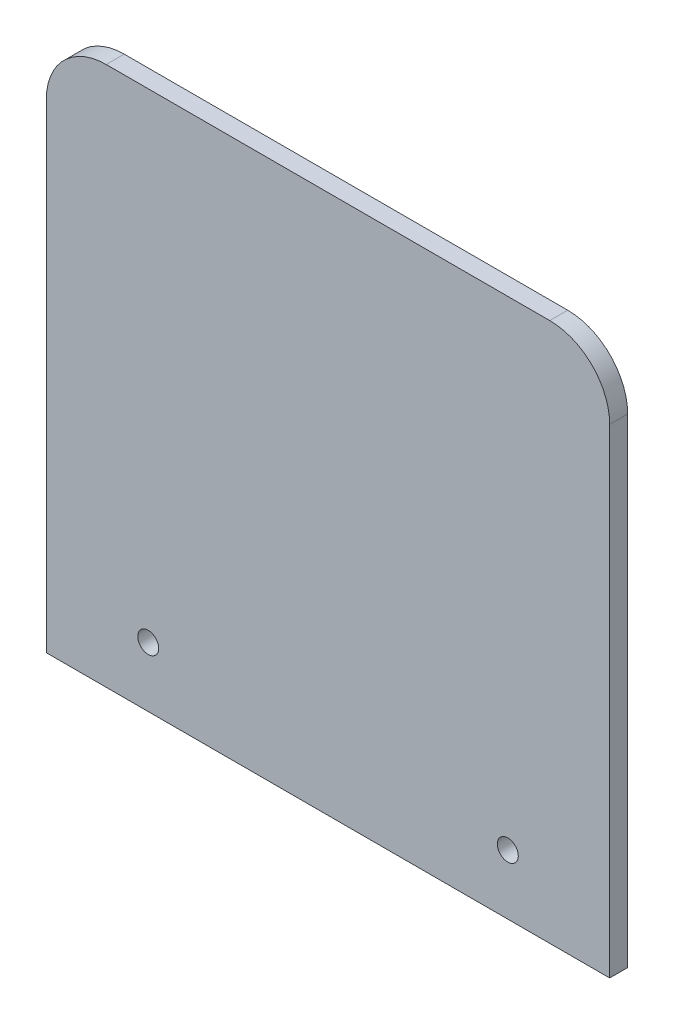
ISO-10303-21;
HEADER;
FILE_DESCRIPTION(('STEP AP214'),'2;1');
FILE_NAME('part.step','',(''),(''),'','','');
FILE_SCHEMA(('AUTOMOTIVE_DESIGN { 1 0 10303 214 1 1 1 1 }'));
ENDSEC;
DATA;
#1=APPLICATION_CONTEXT('core data for automotive mechanical design processes');
#2=APPLICATION_PROTOCOL_DEFINITION('international standard','automotive_design',2000,#1);
#3=PRODUCT_CONTEXT('',#1,'mechanical');
#4=PRODUCT('Part','Part','',(#3));
#5=PRODUCT_RELATED_PRODUCT_CATEGORY('part','',(#4));
#6=PRODUCT_DEFINITION_FORMATION('','',#4);
#7=PRODUCT_DEFINITION_CONTEXT('part definition',#1,'design');
#8=PRODUCT_DEFINITION('design','',#6,#7);
#9=PRODUCT_DEFINITION_SHAPE('','',#8);
#10=(LENGTH_UNIT() NAMED_UNIT(*) SI_UNIT(.MILLI.,.METRE.));
#11=(NAMED_UNIT(*) PLANE_ANGLE_UNIT() SI_UNIT($,.RADIAN.));
#12=(NAMED_UNIT(*) SI_UNIT($,.STERADIAN.) SOLID_ANGLE_UNIT());
#13=UNCERTAINTY_MEASURE_WITH_UNIT(LENGTH_MEASURE(1.E-05),#10,'distance_accuracy_value','');
#14=(GEOMETRIC_REPRESENTATION_CONTEXT(3) GLOBAL_UNCERTAINTY_ASSIGNED_CONTEXT((#13)) GLOBAL_UNIT_ASSIGNED_CONTEXT((#10,
#11,#12)) REPRESENTATION_CONTEXT('',''));
#15=CARTESIAN_POINT('',(0.,0.,0.));
#16=DIRECTION('',(0.,0.,1.));
#17=DIRECTION('',(1.,0.,0.));
#18=AXIS2_PLACEMENT_3D('',#15,#16,#17);
#19=CARTESIAN_POINT('',(10.,80.,3.));
#20=DIRECTION('',(0.,0.,-1.));
#21=DIRECTION('',(-1.,0.,0.));
#22=AXIS2_PLACEMENT_3D('',#19,#20,#21);
#23=PLANE('',#22);
#24=CARTESIAN_POINT('',(77.,10.,3.));
#25=DIRECTION('',(0.,0.,1.));
#26=DIRECTION('',(1.,0.,0.));
#27=AXIS2_PLACEMENT_3D('',#24,#25,#26);
#28=CIRCLE('',#27,1.75);
#29=CARTESIAN_POINT('',(78.75,10.,3.));
#30=VERTEX_POINT('',#29);
#31=EDGE_CURVE('E120',#30,#30,#28,.T.);
#32=ORIENTED_EDGE('',*,*,#31,.F.);
#33=EDGE_LOOP('',(#32));
#34=FACE_BOUND('',#33,.T.);
#35=DIRECTION('',(0.,-1.,0.));
#36=VECTOR('',#35,1.);
#37=CARTESIAN_POINT('',(0.,0.,3.));
#38=LINE('',#37,#36);
#39=CARTESIAN_POINT('',(0.,80.,3.));
#40=VERTEX_POINT('',#39);
#41=CARTESIAN_POINT('',(0.,0.,3.));
#42=VERTEX_POINT('',#41);
#43=EDGE_CURVE('E127',#40,#42,#38,.T.);
#44=ORIENTED_EDGE('',*,*,#43,.T.);
#45=DIRECTION('',(1.,0.,0.));
#46=VECTOR('',#45,1.);
#47=CARTESIAN_POINT('',(0.,0.,3.));
#48=LINE('',#47,#46);
#49=CARTESIAN_POINT('',(94.,0.,3.));
#50=VERTEX_POINT('',#49);
#51=EDGE_CURVE('E85',#42,#50,#48,.T.);
#52=ORIENTED_EDGE('',*,*,#51,.T.);
#53=DIRECTION('',(0.,1.,0.));
#54=VECTOR('',#53,1.);
#55=CARTESIAN_POINT('',(94.,0.,3.));
#56=LINE('',#55,#54);
#57=CARTESIAN_POINT('',(94.,80.0000000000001,3.));
#58=VERTEX_POINT('',#57);
#59=EDGE_CURVE('E98',#50,#58,#56,.T.);
#60=ORIENTED_EDGE('',*,*,#59,.T.);
#61=CARTESIAN_POINT('',(84.,80.0000000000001,3.));
#62=DIRECTION('',(0.,0.,1.));
#63=DIRECTION('',(1.,0.,0.));
#64=AXIS2_PLACEMENT_3D('',#61,#62,#63);
#65=CIRCLE('',#64,9.99999999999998);
#66=CARTESIAN_POINT('',(84.,90.,3.));
#67=VERTEX_POINT('',#66);
#68=EDGE_CURVE('E92',#58,#67,#65,.T.);
#69=ORIENTED_EDGE('',*,*,#68,.T.);
#70=DIRECTION('',(-1.,0.,0.));
#71=VECTOR('',#70,1.);
#72=CARTESIAN_POINT('',(10.,90.,3.));
#73=LINE('',#72,#71);
#74=CARTESIAN_POINT('',(10.,90.,3.));
#75=VERTEX_POINT('',#74);
#76=EDGE_CURVE('E96',#67,#75,#73,.T.);
#77=ORIENTED_EDGE('',*,*,#76,.T.);
#78=CARTESIAN_POINT('',(10.,80.,3.));
#79=DIRECTION('',(0.,0.,1.));
#80=DIRECTION('',(-1.,0.,0.));
#81=AXIS2_PLACEMENT_3D('',#78,#79,#80);
#82=CIRCLE('',#81,9.99999999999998);
#83=EDGE_CURVE('E48',#75,#40,#82,.T.);
#84=ORIENTED_EDGE('',*,*,#83,.T.);
#85=EDGE_LOOP('',(#44,#52,#60,#69,#77,#84));
#86=FACE_BOUND('',#85,.T.);
#87=CARTESIAN_POINT('',(17.,10.,3.));
#88=DIRECTION('',(0.,0.,1.));
#89=DIRECTION('',(1.,0.,0.));
#90=AXIS2_PLACEMENT_3D('',#87,#88,#89);
#91=CIRCLE('',#90,1.75);
#92=CARTESIAN_POINT('',(18.75,10.,3.));
#93=VERTEX_POINT('',#92);
#94=EDGE_CURVE('E170',#93,#93,#91,.T.);
#95=ORIENTED_EDGE('',*,*,#94,.F.);
#96=EDGE_LOOP('',(#95));
#97=FACE_BOUND('',#96,.T.);
#98=ADVANCED_FACE('F31',(#34,#86,#97),#23,.F.);
#99=CARTESIAN_POINT('',(10.,80.,0.));
#100=DIRECTION('',(0.,0.,-1.));
#101=DIRECTION('',(-1.,0.,0.));
#102=AXIS2_PLACEMENT_3D('',#99,#100,#101);
#103=PLANE('',#102);
#104=CARTESIAN_POINT('',(77.,10.,0.));
#105=DIRECTION('',(0.,0.,1.));
#106=DIRECTION('',(1.,0.,0.));
#107=AXIS2_PLACEMENT_3D('',#104,#105,#106);
#108=CIRCLE('',#107,1.75);
#109=CARTESIAN_POINT('',(78.75,10.,0.));
#110=VERTEX_POINT('',#109);
#111=EDGE_CURVE('E175',#110,#110,#108,.T.);
#112=ORIENTED_EDGE('',*,*,#111,.T.);
#113=EDGE_LOOP('',(#112));
#114=FACE_BOUND('',#113,.T.);
#115=DIRECTION('',(0.,-1.,0.));
#116=VECTOR('',#115,1.);
#117=CARTESIAN_POINT('',(0.,0.,0.));
#118=LINE('',#117,#116);
#119=CARTESIAN_POINT('',(0.,80.,0.));
#120=VERTEX_POINT('',#119);
#121=CARTESIAN_POINT('',(0.,0.,0.));
#122=VERTEX_POINT('',#121);
#123=EDGE_CURVE('E116',#120,#122,#118,.T.);
#124=ORIENTED_EDGE('',*,*,#123,.F.);
#125=CARTESIAN_POINT('',(10.,80.,0.));
#126=DIRECTION('',(0.,0.,1.));
#127=DIRECTION('',(-1.,0.,0.));
#128=AXIS2_PLACEMENT_3D('',#125,#126,#127);
#129=CIRCLE('',#128,9.99999999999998);
#130=CARTESIAN_POINT('',(10.,90.,0.));
#131=VERTEX_POINT('',#130);
#132=EDGE_CURVE('E77',#131,#120,#129,.T.);
#133=ORIENTED_EDGE('',*,*,#132,.F.);
#134=DIRECTION('',(-1.,0.,0.));
#135=VECTOR('',#134,1.);
#136=CARTESIAN_POINT('',(10.,90.,0.));
#137=LINE('',#136,#135);
#138=CARTESIAN_POINT('',(84.,90.,0.));
#139=VERTEX_POINT('',#138);
#140=EDGE_CURVE('E71',#139,#131,#137,.T.);
#141=ORIENTED_EDGE('',*,*,#140,.F.);
#142=CARTESIAN_POINT('',(84.,80.0000000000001,0.));
#143=DIRECTION('',(0.,0.,1.));
#144=DIRECTION('',(1.,0.,0.));
#145=AXIS2_PLACEMENT_3D('',#142,#143,#144);
#146=CIRCLE('',#145,9.99999999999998);
#147=CARTESIAN_POINT('',(94.,80.0000000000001,0.));
#148=VERTEX_POINT('',#147);
#149=EDGE_CURVE('E106',#148,#139,#146,.T.);
#150=ORIENTED_EDGE('',*,*,#149,.F.);
#151=DIRECTION('',(0.,1.,0.));
#152=VECTOR('',#151,1.);
#153=CARTESIAN_POINT('',(94.,0.,0.));
#154=LINE('',#153,#152);
#155=CARTESIAN_POINT('',(94.,0.,0.));
#156=VERTEX_POINT('',#155);
#157=EDGE_CURVE('E122',#156,#148,#154,.T.);
#158=ORIENTED_EDGE('',*,*,#157,.F.);
#159=DIRECTION('',(1.,0.,0.));
#160=VECTOR('',#159,1.);
#161=CARTESIAN_POINT('',(0.,0.,0.));
#162=LINE('',#161,#160);
#163=EDGE_CURVE('E119',#122,#156,#162,.T.);
#164=ORIENTED_EDGE('',*,*,#163,.F.);
#165=EDGE_LOOP('',(#124,#133,#141,#150,#158,#164));
#166=FACE_BOUND('',#165,.T.);
#167=CARTESIAN_POINT('',(17.,10.,0.));
#168=DIRECTION('',(0.,0.,1.));
#169=DIRECTION('',(1.,0.,0.));
#170=AXIS2_PLACEMENT_3D('',#167,#168,#169);
#171=CIRCLE('',#170,1.75);
#172=CARTESIAN_POINT('',(18.75,10.,0.));
#173=VERTEX_POINT('',#172);
#174=EDGE_CURVE('E173',#173,#173,#171,.T.);
#175=ORIENTED_EDGE('',*,*,#174,.T.);
#176=EDGE_LOOP('',(#175));
#177=FACE_BOUND('',#176,.T.);
#178=ADVANCED_FACE('F136',(#114,#166,#177),#103,.T.);
#179=CARTESIAN_POINT('',(0.,0.,3.));
#180=DIRECTION('',(1.,0.,0.));
#181=DIRECTION('',(0.,0.,-1.));
#182=AXIS2_PLACEMENT_3D('',#179,#180,#181);
#183=PLANE('',#182);
#184=ORIENTED_EDGE('',*,*,#123,.T.);
#185=DIRECTION('',(0.,0.,-1.));
#186=VECTOR('',#185,1.);
#187=CARTESIAN_POINT('',(0.,0.,3.));
#188=LINE('',#187,#186);
#189=EDGE_CURVE('E11',#42,#122,#188,.T.);
#190=ORIENTED_EDGE('',*,*,#189,.F.);
#191=ORIENTED_EDGE('',*,*,#43,.F.);
#192=DIRECTION('',(0.,0.,-1.));
#193=VECTOR('',#192,1.);
#194=CARTESIAN_POINT('',(0.,80.,3.));
#195=LINE('',#194,#193);
#196=EDGE_CURVE('E112',#40,#120,#195,.T.);
#197=ORIENTED_EDGE('',*,*,#196,.T.);
#198=EDGE_LOOP('',(#184,#190,#191,#197));
#199=FACE_BOUND('',#198,.T.);
#200=ADVANCED_FACE('F33',(#199),#183,.F.);
#201=CARTESIAN_POINT('',(0.,0.,3.));
#202=DIRECTION('',(0.,1.,0.));
#203=DIRECTION('',(-1.,0.,0.));
#204=AXIS2_PLACEMENT_3D('',#201,#202,#203);
#205=PLANE('',#204);
#206=ORIENTED_EDGE('',*,*,#163,.T.);
#207=DIRECTION('',(0.,0.,-1.));
#208=VECTOR('',#207,1.);
#209=CARTESIAN_POINT('',(94.,0.,3.));
#210=LINE('',#209,#208);
#211=EDGE_CURVE('E40',#50,#156,#210,.T.);
#212=ORIENTED_EDGE('',*,*,#211,.F.);
#213=ORIENTED_EDGE('',*,*,#51,.F.);
#214=ORIENTED_EDGE('',*,*,#189,.T.);
#215=EDGE_LOOP('',(#206,#212,#213,#214));
#216=FACE_BOUND('',#215,.T.);
#217=ADVANCED_FACE('F216',(#216),#205,.F.);
#218=CARTESIAN_POINT('',(94.,0.,3.));
#219=DIRECTION('',(-1.,0.,0.));
#220=DIRECTION('',(0.,-1.,0.));
#221=AXIS2_PLACEMENT_3D('',#218,#219,#220);
#222=PLANE('',#221);
#223=ORIENTED_EDGE('',*,*,#157,.T.);
#224=DIRECTION('',(0.,0.,-1.));
#225=VECTOR('',#224,1.);
#226=CARTESIAN_POINT('',(94.,80.0000000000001,3.));
#227=LINE('',#226,#225);
#228=EDGE_CURVE('E107',#58,#148,#227,.T.);
#229=ORIENTED_EDGE('',*,*,#228,.F.);
#230=ORIENTED_EDGE('',*,*,#59,.F.);
#231=ORIENTED_EDGE('',*,*,#211,.T.);
#232=EDGE_LOOP('',(#223,#229,#230,#231));
#233=FACE_BOUND('',#232,.T.);
#234=ADVANCED_FACE('F133',(#233),#222,.F.);
#235=CARTESIAN_POINT('',(84.,80.0000000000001,3.));
#236=DIRECTION('',(0.,0.,-1.));
#237=DIRECTION('',(-1.,0.,0.));
#238=AXIS2_PLACEMENT_3D('',#235,#236,#237);
#239=CYLINDRICAL_SURFACE('',#238,9.99999999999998);
#240=ORIENTED_EDGE('',*,*,#149,.T.);
#241=DIRECTION('',(0.,0.,-1.));
#242=VECTOR('',#241,1.);
#243=CARTESIAN_POINT('',(84.,90.,3.));
#244=LINE('',#243,#242);
#245=EDGE_CURVE('E103',#67,#139,#244,.T.);
#246=ORIENTED_EDGE('',*,*,#245,.F.);
#247=ORIENTED_EDGE('',*,*,#68,.F.);
#248=ORIENTED_EDGE('',*,*,#228,.T.);
#249=EDGE_LOOP('',(#240,#246,#247,#248));
#250=FACE_BOUND('',#249,.T.);
#251=ADVANCED_FACE('F104',(#250),#239,.T.);
#252=CARTESIAN_POINT('',(10.,90.,3.));
#253=DIRECTION('',(0.,-1.,0.));
#254=DIRECTION('',(1.,0.,0.));
#255=AXIS2_PLACEMENT_3D('',#252,#253,#254);
#256=PLANE('',#255);
#257=ORIENTED_EDGE('',*,*,#140,.T.);
#258=DIRECTION('',(0.,0.,-1.));
#259=VECTOR('',#258,1.);
#260=CARTESIAN_POINT('',(10.,90.,3.));
#261=LINE('',#260,#259);
#262=EDGE_CURVE('E108',#75,#131,#261,.T.);
#263=ORIENTED_EDGE('',*,*,#262,.F.);
#264=ORIENTED_EDGE('',*,*,#76,.F.);
#265=ORIENTED_EDGE('',*,*,#245,.T.);
#266=EDGE_LOOP('',(#257,#263,#264,#265));
#267=FACE_BOUND('',#266,.T.);
#268=ADVANCED_FACE('F110',(#267),#256,.F.);
#269=CARTESIAN_POINT('',(10.,80.,3.));
#270=DIRECTION('',(0.,0.,-1.));
#271=DIRECTION('',(-1.,0.,0.));
#272=AXIS2_PLACEMENT_3D('',#269,#270,#271);
#273=CYLINDRICAL_SURFACE('',#272,9.99999999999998);
#274=ORIENTED_EDGE('',*,*,#132,.T.);
#275=ORIENTED_EDGE('',*,*,#196,.F.);
#276=ORIENTED_EDGE('',*,*,#83,.F.);
#277=ORIENTED_EDGE('',*,*,#262,.T.);
#278=EDGE_LOOP('',(#274,#275,#276,#277));
#279=FACE_BOUND('',#278,.T.);
#280=ADVANCED_FACE('F141',(#279),#273,.T.);
#281=CARTESIAN_POINT('',(77.,10.,3.));
#282=DIRECTION('',(0.,0.,-1.));
#283=DIRECTION('',(-1.,0.,0.));
#284=AXIS2_PLACEMENT_3D('',#281,#282,#283);
#285=CYLINDRICAL_SURFACE('',#284,1.75);
#286=ORIENTED_EDGE('',*,*,#31,.T.);
#287=EDGE_LOOP('',(#286));
#288=FACE_BOUND('',#287,.T.);
#289=ORIENTED_EDGE('',*,*,#111,.F.);
#290=EDGE_LOOP('',(#289));
#291=FACE_BOUND('',#290,.T.);
#292=ADVANCED_FACE('F143',(#288,#291),#285,.F.);
#293=CARTESIAN_POINT('',(17.,10.,3.));
#294=DIRECTION('',(0.,0.,-1.));
#295=DIRECTION('',(-1.,0.,0.));
#296=AXIS2_PLACEMENT_3D('',#293,#294,#295);
#297=CYLINDRICAL_SURFACE('',#296,1.75);
#298=ORIENTED_EDGE('',*,*,#94,.T.);
#299=EDGE_LOOP('',(#298));
#300=FACE_BOUND('',#299,.T.);
#301=ORIENTED_EDGE('',*,*,#174,.F.);
#302=EDGE_LOOP('',(#301));
#303=FACE_BOUND('',#302,.T.);
#304=ADVANCED_FACE('F149',(#300,#303),#297,.F.);
#305=CLOSED_SHELL('',(#98,#178,#200,#217,#234,#251,#268,#280,#292,#304));
#306=MANIFOLD_SOLID_BREP('B2',#305);
#307=ADVANCED_BREP_SHAPE_REPRESENTATION('',(#18,#306),#14);
#308=SHAPE_DEFINITION_REPRESENTATION(#9,#307);
ENDSEC;
END-ISO-10303-21;
